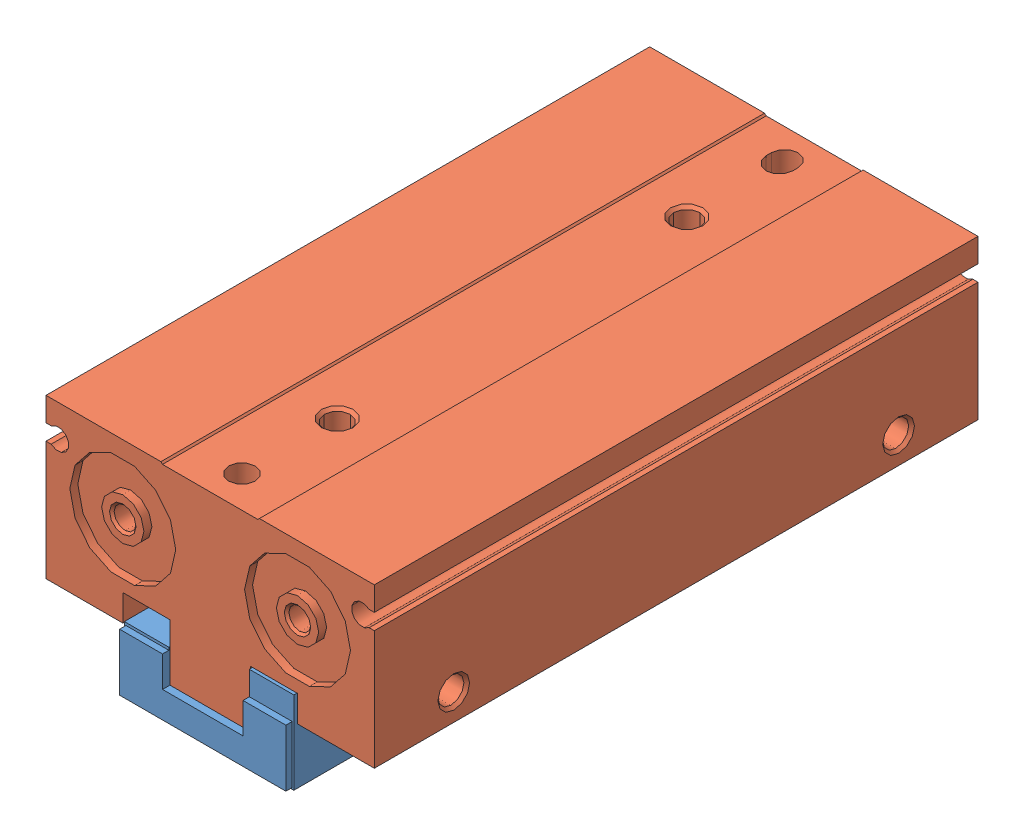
SolidWorks assembly SHF20-40D.sldasm, configuration Default (file format 11000). Lengths in mm.
Overall size (62 41 116.8).
3 component instances, 2 part files, 0 mates.
Components (placement in the parent):
- SHF20-4002-1: SHF20-4002.sldprt [Default] at (0 -41 -20) x (-1 0 0) z (0 0 -1) size (32 17.6 75.2)
- SHF20-4002-2: SHF20-4002.sldprt [Default] at (0 -41 20) size (32 17.6 75.2)
- SHF20-4001-1: SHF20-4001.sldprt [Default] at origin size (62 35.7 114)
